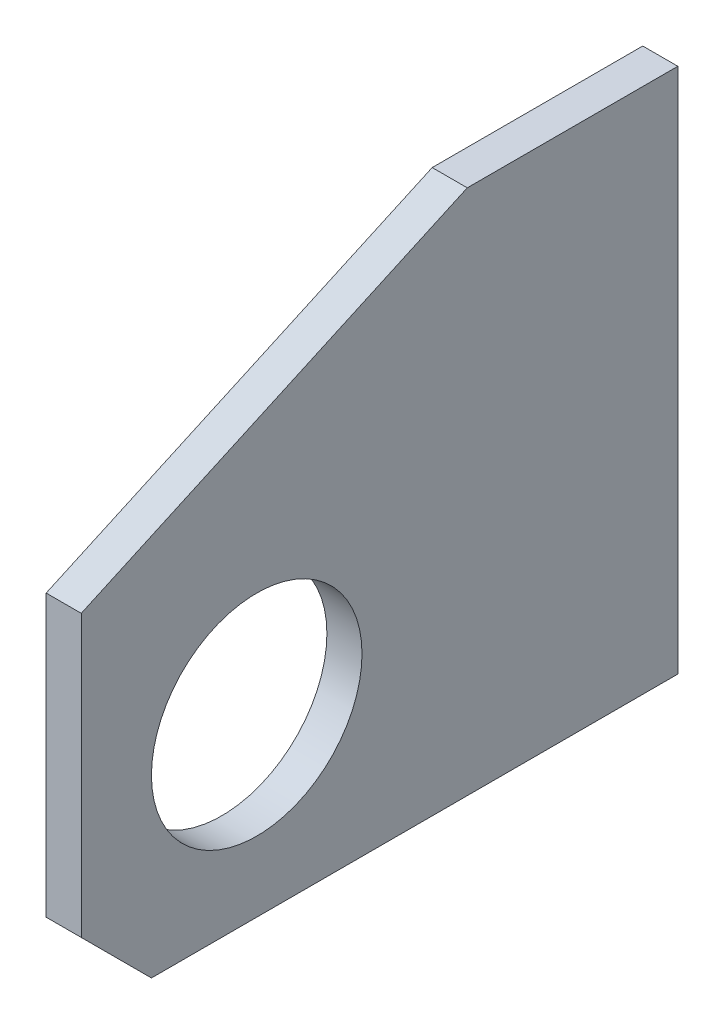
from build123d import *

# Parameters (mm, degrees)
BOSS_EXTRUDE1_DEPTH = 10
SKETCH2_R           = 30
CUT_EXTRUDE1_DEPTH  = 10
CHAMFER1_SIZE       = 20


with BuildPart() as part:
    # Sketch1 → Boss-Extrude1 (new body)
    with BuildSketch(Plane(origin=(0, 0, 0), x_dir=(0, 0, -1), z_dir=(1, 0, 0))):
        Polygon((0, 150), (0, 0), (-170, 0), (-170, 100), (-60, 150), align=None)
    extrude(amount=BOSS_EXTRUDE1_DEPTH)

    # Sketch2 → Cut-Extrude1 (cut)
    with BuildSketch(Plane(origin=(10, 0, 0), x_dir=(0, 0, -1), z_dir=(1, 0, 0))):
        with Locations((-120, 50)):
            Circle(SKETCH2_R)
    extrude(amount=-CUT_EXTRUDE1_DEPTH, mode=Mode.SUBTRACT)

    # Chamfer1
    chamfer1_edges = [part.edges().sort_by_distance(p)[0] for p in [
        (5, 0, 170),
    ]]
    chamfer(chamfer1_edges, length=CHAMFER1_SIZE)


solid = part.part
